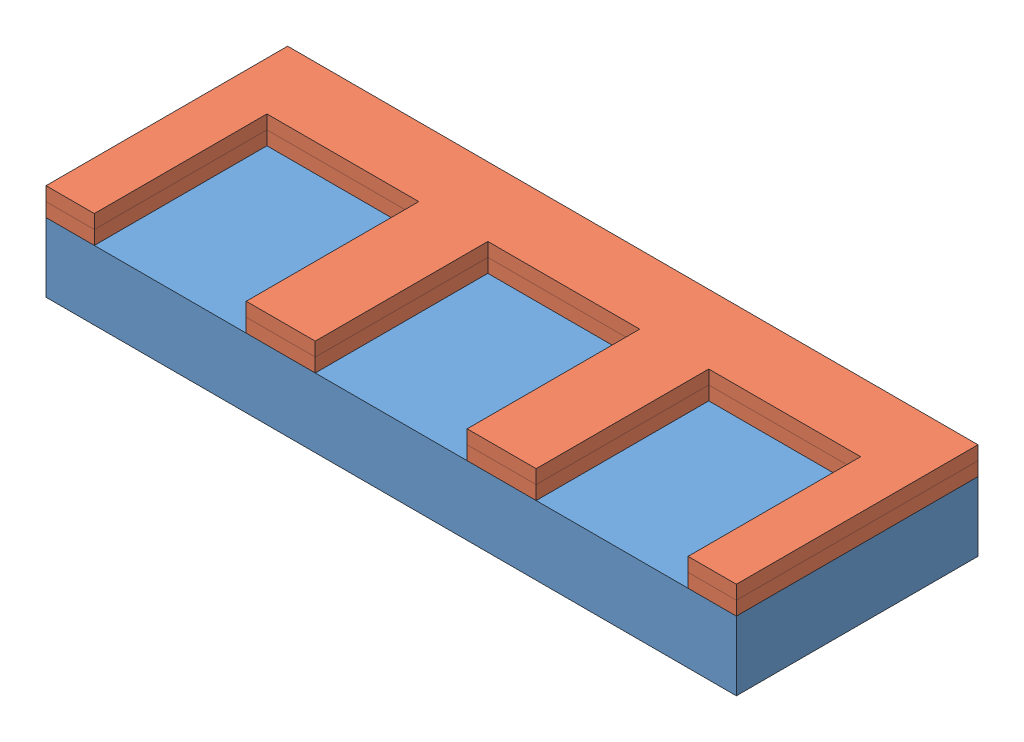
SolidWorks assembly Return Carrier.SLDASM, configuration Default (file format 15000). Lengths in mm.
Overall size (1000 140 350).
3 component instances, 2 part files, 6 mates.
Components (placement in the parent):
- Return Base-1: Return Base.SLDPRT [Default] at (219.3956 434.6045 908.0612) size (1000 100 350)
- Return Rack-7: Return Rack.SLDPRT [Default] at (219.3956 534.6045 908.0612) size (1000 20 350)
- Return Rack-8: Return Rack.SLDPRT [Default] at (219.3956 554.6045 908.0612) size (1000 20 350)
Mates (geometry in assembly coordinates):
- Coincident22: coincident anti-aligned: plane of Return Base-1 through (219.3956 534.6045 908.0612) normal (0 1 0); plane of Return Rack-7 through (219.3956 534.6045 908.0612) normal (0 -1 0)
- Coincident23: coincident aligned: plane of Return Base-1 through (-280.6044 534.6045 1083.0612) normal (0 0 1); plane of Return Rack-7 through (-280.6044 554.6045 1083.0612) normal (0 0 1)
- Coincident24: coincident aligned: plane of Return Base-1 through (-280.6044 534.6045 1083.0612) normal (-1 0 0); plane of Return Rack-7 through (-280.6044 554.6045 1083.0612) normal (-1 0 0)
- Coincident27: coincident anti-aligned: plane of Return Rack-7 through (219.3956 554.6045 908.0612) normal (0 1 0); plane of Return Rack-8 through (219.3956 554.6045 908.0612) normal (0 -1 0)
- Coincident28: coincident aligned: plane of Return Rack-7 through (-280.6044 554.6045 1083.0612) normal (0 0 1); plane of Return Rack-8 through (-280.6044 574.6045 1083.0612) normal (0 0 1)
- Coincident29: coincident aligned: plane of Return Rack-7 through (-280.6044 554.6045 1083.0612) normal (-1 0 0); plane of Return Rack-8 through (-280.6044 574.6045 1083.0612) normal (-1 0 0)
